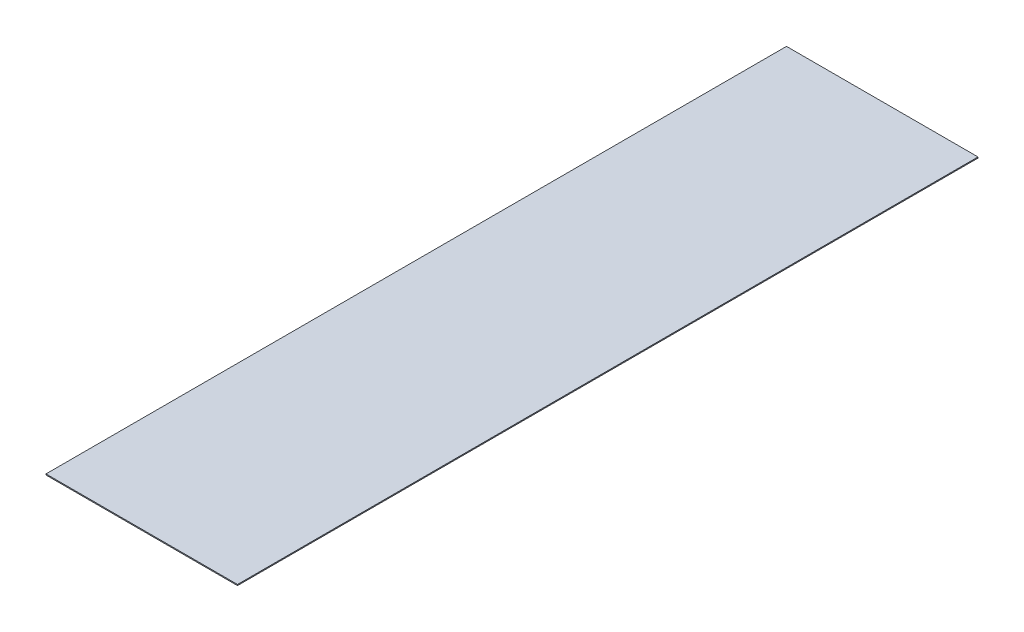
from build123d import *

# Parameters (mm, degrees)
SKETCH1_W           = 47.625
SKETCH1_H           = 184.15
BOSS_EXTRUDE1_DEPTH = 0.254


with BuildPart() as part:
    # Sketch1 → Boss-Extrude1 (new body)
    with BuildSketch(Plane(origin=(0, 0, 0), x_dir=(1, 0, 0), z_dir=(0, 1, 0))):
        with Locations((42.8625, 15.875)):
            Rectangle(SKETCH1_W, SKETCH1_H)
    extrude(amount=BOSS_EXTRUDE1_DEPTH)


solid = part.part
